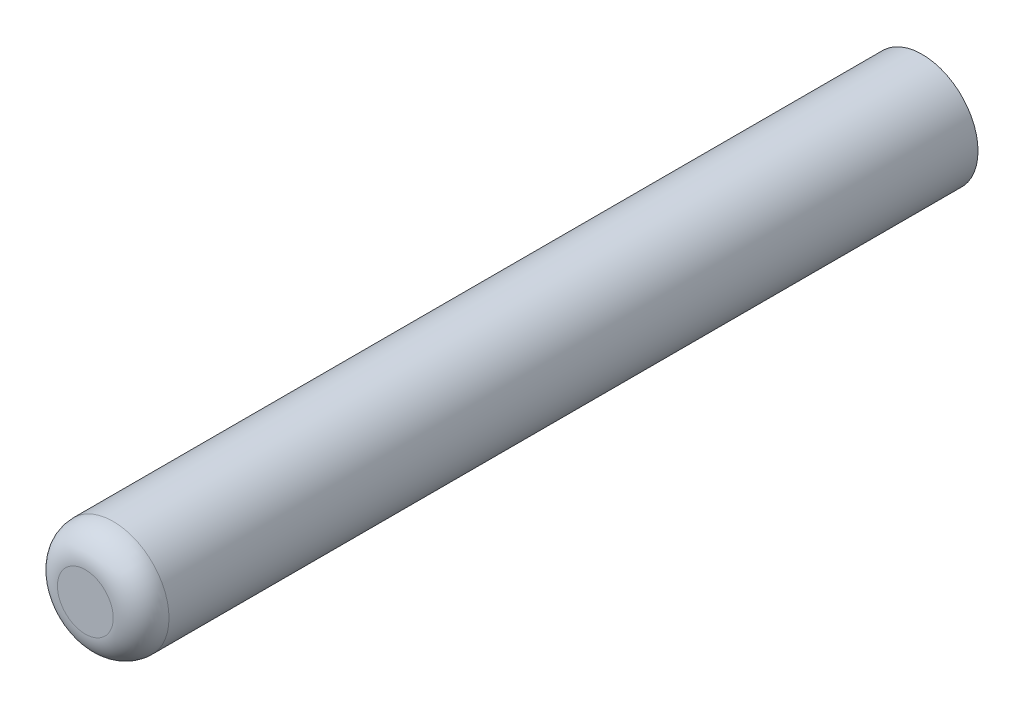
from build123d import *

# Parameters (mm, degrees)
ESQUISSE1_R            = 1
CYLINDRE_DE_BASE_DEPTH = 7.5
CONG_1_R               = 0.5


with BuildPart() as part:
    # Esquisse1 → Cylindre de base (new, symmetric)
    with BuildSketch(Plane.XY):
        Circle(ESQUISSE1_R)
    extrude(amount=CYLINDRE_DE_BASE_DEPTH, both=True)

    # Cong_1
    cong_1_edges = [part.edges().sort_by_distance(p)[0] for p in [
        (-1, 0, 7.5),
    ]]
    fillet(cong_1_edges, radius=CONG_1_R)


solid = part.part
